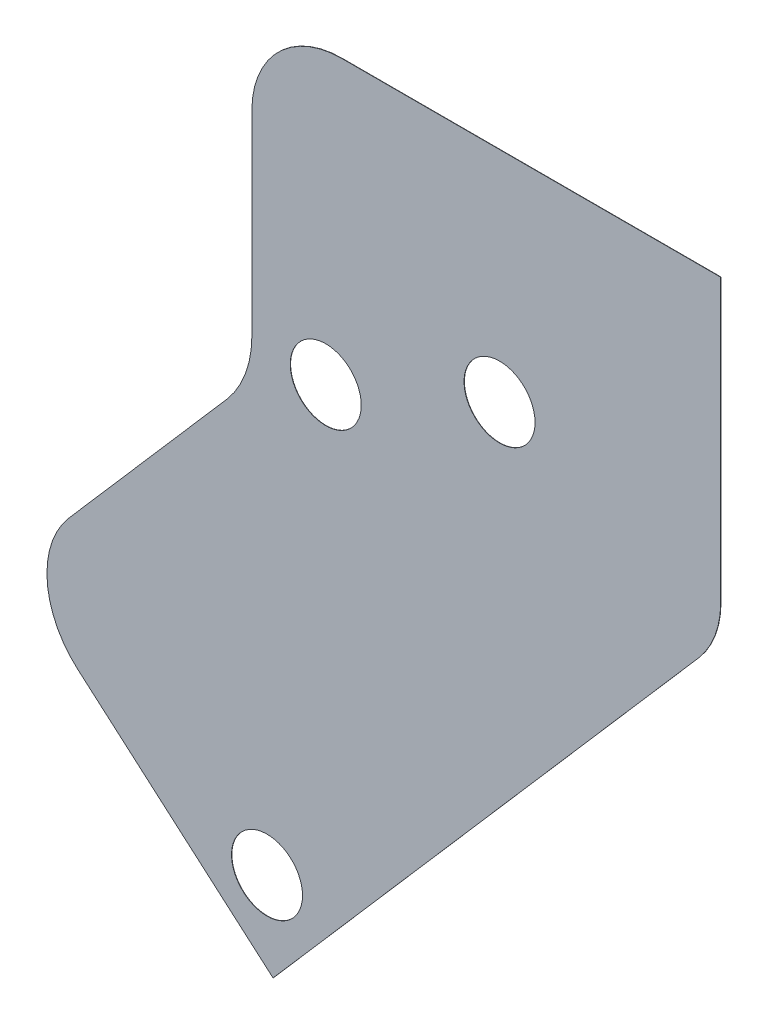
ISO-10303-21;
HEADER;
FILE_DESCRIPTION(('STEP AP214'),'2;1');
FILE_NAME('part.step','',(''),(''),'','','');
FILE_SCHEMA(('AUTOMOTIVE_DESIGN { 1 0 10303 214 1 1 1 1 }'));
ENDSEC;
DATA;
#1=APPLICATION_CONTEXT('core data for automotive mechanical design processes');
#2=APPLICATION_PROTOCOL_DEFINITION('international standard','automotive_design',2000,#1);
#3=PRODUCT_CONTEXT('',#1,'mechanical');
#4=PRODUCT('Part','Part','',(#3));
#5=PRODUCT_RELATED_PRODUCT_CATEGORY('part','',(#4));
#6=PRODUCT_DEFINITION_FORMATION('','',#4);
#7=PRODUCT_DEFINITION_CONTEXT('part definition',#1,'design');
#8=PRODUCT_DEFINITION('design','',#6,#7);
#9=PRODUCT_DEFINITION_SHAPE('','',#8);
#10=(LENGTH_UNIT() NAMED_UNIT(*) SI_UNIT(.MILLI.,.METRE.));
#11=(NAMED_UNIT(*) PLANE_ANGLE_UNIT() SI_UNIT($,.RADIAN.));
#12=(NAMED_UNIT(*) SI_UNIT($,.STERADIAN.) SOLID_ANGLE_UNIT());
#13=UNCERTAINTY_MEASURE_WITH_UNIT(LENGTH_MEASURE(1.E-05),#10,'distance_accuracy_value','');
#14=(GEOMETRIC_REPRESENTATION_CONTEXT(3) GLOBAL_UNCERTAINTY_ASSIGNED_CONTEXT((#13)) GLOBAL_UNIT_ASSIGNED_CONTEXT((#10,
#11,#12)) REPRESENTATION_CONTEXT('',''));
#15=CARTESIAN_POINT('',(0.,0.,0.));
#16=DIRECTION('',(0.,0.,1.));
#17=DIRECTION('',(1.,0.,0.));
#18=AXIS2_PLACEMENT_3D('',#15,#16,#17);
#19=CARTESIAN_POINT('',(-671.195,-35.989792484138,0.0254000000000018));
#20=DIRECTION('',(0.,0.,-1.));
#21=DIRECTION('',(-1.,0.,0.));
#22=AXIS2_PLACEMENT_3D('',#19,#20,#21);
#23=CYLINDRICAL_SURFACE('',#22,7.11199999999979);
#24=CARTESIAN_POINT('',(-671.195,-35.989792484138,0.));
#25=DIRECTION('',(0.,0.,1.));
#26=DIRECTION('',(1.,0.,0.));
#27=AXIS2_PLACEMENT_3D('',#24,#25,#26);
#28=CIRCLE('',#27,7.11199999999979);
#29=CARTESIAN_POINT('',(-665.825225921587,-40.6530606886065,0.));
#30=VERTEX_POINT('',#29);
#31=CARTESIAN_POINT('',(-664.083,-35.989792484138,0.));
#32=VERTEX_POINT('',#31);
#33=EDGE_CURVE('E159',#30,#32,#28,.T.);
#34=ORIENTED_EDGE('',*,*,#33,.T.);
#35=DIRECTION('',(0.,0.,-1.));
#36=VECTOR('',#35,1.);
#37=CARTESIAN_POINT('',(-664.083,-35.989792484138,0.0254000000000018));
#38=LINE('',#37,#36);
#39=CARTESIAN_POINT('',(-664.083,-35.989792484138,0.0254000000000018));
#40=VERTEX_POINT('',#39);
#41=EDGE_CURVE('E11',#40,#32,#38,.T.);
#42=ORIENTED_EDGE('',*,*,#41,.F.);
#43=CARTESIAN_POINT('',(-671.195,-35.989792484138,0.0254000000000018));
#44=DIRECTION('',(0.,0.,1.));
#45=DIRECTION('',(1.,0.,0.));
#46=AXIS2_PLACEMENT_3D('',#43,#44,#45);
#47=CIRCLE('',#46,7.11199999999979);
#48=CARTESIAN_POINT('',(-665.825225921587,-40.6530606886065,0.0254000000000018));
#49=VERTEX_POINT('',#48);
#50=EDGE_CURVE('E188',#49,#40,#47,.T.);
#51=ORIENTED_EDGE('',*,*,#50,.F.);
#52=DIRECTION('',(0.,0.,-1.));
#53=VECTOR('',#52,1.);
#54=CARTESIAN_POINT('',(-665.825225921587,-40.6530606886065,0.0254000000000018));
#55=LINE('',#54,#53);
#56=EDGE_CURVE('E155',#49,#30,#55,.T.);
#57=ORIENTED_EDGE('',*,*,#56,.T.);
#58=EDGE_LOOP('',(#34,#42,#51,#57));
#59=FACE_BOUND('',#58,.T.);
#60=ADVANCED_FACE('F45',(#59),#23,.T.);
#61=CARTESIAN_POINT('',(-664.083,-35.989792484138,0.0254000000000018));
#62=DIRECTION('',(-1.,0.,0.));
#63=DIRECTION('',(0.,0.,1.));
#64=AXIS2_PLACEMENT_3D('',#61,#62,#63);
#65=PLANE('',#64);
#66=DIRECTION('',(0.,1.,0.));
#67=VECTOR('',#66,1.);
#68=CARTESIAN_POINT('',(-664.083,-35.989792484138,0.));
#69=LINE('',#68,#67);
#70=CARTESIAN_POINT('',(-664.083,-13.7078728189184,0.));
#71=VERTEX_POINT('',#70);
#72=EDGE_CURVE('E163',#32,#71,#69,.T.);
#73=ORIENTED_EDGE('',*,*,#72,.T.);
#74=DIRECTION('',(0.,0.,-1.));
#75=VECTOR('',#74,1.);
#76=CARTESIAN_POINT('',(-664.083,-13.7078728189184,0.0254000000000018));
#77=LINE('',#76,#75);
#78=CARTESIAN_POINT('',(-664.083,-13.7078728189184,0.0254000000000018));
#79=VERTEX_POINT('',#78);
#80=EDGE_CURVE('E54',#79,#71,#77,.T.);
#81=ORIENTED_EDGE('',*,*,#80,.F.);
#82=DIRECTION('',(0.,1.,0.));
#83=VECTOR('',#82,1.);
#84=CARTESIAN_POINT('',(-664.083,-35.989792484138,0.0254000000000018));
#85=LINE('',#84,#83);
#86=EDGE_CURVE('E111',#40,#79,#85,.T.);
#87=ORIENTED_EDGE('',*,*,#86,.F.);
#88=ORIENTED_EDGE('',*,*,#41,.T.);
#89=EDGE_LOOP('',(#73,#81,#87,#88));
#90=FACE_BOUND('',#89,.T.);
#91=ADVANCED_FACE('F310',(#90),#65,.F.);
#92=CARTESIAN_POINT('',(-664.083,-13.7078728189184,0.0254000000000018));
#93=DIRECTION('',(0.,-1.,0.));
#94=DIRECTION('',(1.,0.,0.));
#95=AXIS2_PLACEMENT_3D('',#92,#93,#94);
#96=PLANE('',#95);
#97=DIRECTION('',(-1.,0.,0.));
#98=VECTOR('',#97,1.);
#99=CARTESIAN_POINT('',(-664.083,-13.7078728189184,0.));
#100=LINE('',#99,#98);
#101=CARTESIAN_POINT('',(-694.055,-13.7078728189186,0.));
#102=VERTEX_POINT('',#101);
#103=EDGE_CURVE('E167',#71,#102,#100,.T.);
#104=ORIENTED_EDGE('',*,*,#103,.T.);
#105=DIRECTION('',(0.,0.,-1.));
#106=VECTOR('',#105,1.);
#107=CARTESIAN_POINT('',(-694.055,-13.7078728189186,0.0254000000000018));
#108=LINE('',#107,#106);
#109=CARTESIAN_POINT('',(-694.055,-13.7078728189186,0.0254000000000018));
#110=VERTEX_POINT('',#109);
#111=EDGE_CURVE('E207',#110,#102,#108,.T.);
#112=ORIENTED_EDGE('',*,*,#111,.F.);
#113=DIRECTION('',(-1.,0.,0.));
#114=VECTOR('',#113,1.);
#115=CARTESIAN_POINT('',(-664.083,-13.7078728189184,0.0254000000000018));
#116=LINE('',#115,#114);
#117=EDGE_CURVE('E218',#79,#110,#116,.T.);
#118=ORIENTED_EDGE('',*,*,#117,.F.);
#119=ORIENTED_EDGE('',*,*,#80,.T.);
#120=EDGE_LOOP('',(#104,#112,#118,#119));
#121=FACE_BOUND('',#120,.T.);
#122=ADVANCED_FACE('F216',(#121),#96,.F.);
#123=CARTESIAN_POINT('',(-694.055,-20.8198728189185,0.0254000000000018));
#124=DIRECTION('',(0.,0.,-1.));
#125=DIRECTION('',(-1.,0.,0.));
#126=AXIS2_PLACEMENT_3D('',#123,#124,#125);
#127=CYLINDRICAL_SURFACE('',#126,7.11199999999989);
#128=CARTESIAN_POINT('',(-694.055,-20.8198728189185,0.));
#129=DIRECTION('',(0.,0.,1.));
#130=DIRECTION('',(1.,0.,0.));
#131=AXIS2_PLACEMENT_3D('',#128,#129,#130);
#132=CIRCLE('',#131,7.11199999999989);
#133=CARTESIAN_POINT('',(-701.167,-20.8198728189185,0.));
#134=VERTEX_POINT('',#133);
#135=EDGE_CURVE('E170',#102,#134,#132,.T.);
#136=ORIENTED_EDGE('',*,*,#135,.T.);
#137=DIRECTION('',(0.,0.,-1.));
#138=VECTOR('',#137,1.);
#139=CARTESIAN_POINT('',(-701.167,-20.8198728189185,0.0254000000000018));
#140=LINE('',#139,#138);
#141=CARTESIAN_POINT('',(-701.167,-20.8198728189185,0.0254000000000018));
#142=VERTEX_POINT('',#141);
#143=EDGE_CURVE('E203',#142,#134,#140,.T.);
#144=ORIENTED_EDGE('',*,*,#143,.F.);
#145=CARTESIAN_POINT('',(-694.055,-20.8198728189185,0.0254000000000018));
#146=DIRECTION('',(0.,0.,1.));
#147=DIRECTION('',(1.,0.,0.));
#148=AXIS2_PLACEMENT_3D('',#145,#146,#147);
#149=CIRCLE('',#148,7.11199999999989);
#150=EDGE_CURVE('E237',#110,#142,#149,.T.);
#151=ORIENTED_EDGE('',*,*,#150,.F.);
#152=ORIENTED_EDGE('',*,*,#111,.T.);
#153=EDGE_LOOP('',(#136,#144,#151,#152));
#154=FACE_BOUND('',#153,.T.);
#155=ADVANCED_FACE('F227',(#154),#127,.T.);
#156=CARTESIAN_POINT('',(-701.167,-20.8198728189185,0.0254000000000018));
#157=DIRECTION('',(1.,0.,0.));
#158=DIRECTION('',(0.,1.,0.));
#159=AXIS2_PLACEMENT_3D('',#156,#157,#158);
#160=PLANE('',#159);
#161=DIRECTION('',(0.,-1.,0.));
#162=VECTOR('',#161,1.);
#163=CARTESIAN_POINT('',(-701.167,-20.8198728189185,0.));
#164=LINE('',#163,#162);
#165=CARTESIAN_POINT('',(-701.167,-36.2820751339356,0.));
#166=VERTEX_POINT('',#165);
#167=EDGE_CURVE('E173',#134,#166,#164,.T.);
#168=ORIENTED_EDGE('',*,*,#167,.T.);
#169=DIRECTION('',(0.,0.,-1.));
#170=VECTOR('',#169,1.);
#171=CARTESIAN_POINT('',(-701.167,-36.2820751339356,0.0254000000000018));
#172=LINE('',#171,#170);
#173=CARTESIAN_POINT('',(-701.167,-36.2820751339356,0.0254000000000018));
#174=VERTEX_POINT('',#173);
#175=EDGE_CURVE('E199',#174,#166,#172,.T.);
#176=ORIENTED_EDGE('',*,*,#175,.F.);
#177=DIRECTION('',(0.,-1.,0.));
#178=VECTOR('',#177,1.);
#179=CARTESIAN_POINT('',(-701.167,-20.8198728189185,0.0254000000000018));
#180=LINE('',#179,#178);
#181=EDGE_CURVE('E233',#142,#174,#180,.T.);
#182=ORIENTED_EDGE('',*,*,#181,.F.);
#183=ORIENTED_EDGE('',*,*,#143,.T.);
#184=EDGE_LOOP('',(#168,#176,#182,#183));
#185=FACE_BOUND('',#184,.T.);
#186=ADVANCED_FACE('F231',(#185),#160,.F.);
#187=CARTESIAN_POINT('',(-709.295,-36.2820751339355,0.0254000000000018));
#188=DIRECTION('',(0.,0.,-1.));
#189=DIRECTION('',(-1.,0.,0.));
#190=AXIS2_PLACEMENT_3D('',#187,#188,#189);
#191=CYLINDRICAL_SURFACE('',#190,8.12799999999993);
#192=CARTESIAN_POINT('',(-709.295,-36.2820751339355,0.));
#193=DIRECTION('',(0.,0.,-1.));
#194=DIRECTION('',(1.,0.,0.));
#195=AXIS2_PLACEMENT_3D('',#192,#193,#194);
#196=CIRCLE('',#195,8.12799999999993);
#197=CARTESIAN_POINT('',(-703.158115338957,-41.6115245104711,0.));
#198=VERTEX_POINT('',#197);
#199=EDGE_CURVE('E176',#166,#198,#196,.T.);
#200=ORIENTED_EDGE('',*,*,#199,.T.);
#201=DIRECTION('',(0.,0.,-1.));
#202=VECTOR('',#201,1.);
#203=CARTESIAN_POINT('',(-703.158115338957,-41.6115245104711,0.0254000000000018));
#204=LINE('',#203,#202);
#205=CARTESIAN_POINT('',(-703.158115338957,-41.6115245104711,0.0254000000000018));
#206=VERTEX_POINT('',#205);
#207=EDGE_CURVE('E195',#206,#198,#204,.T.);
#208=ORIENTED_EDGE('',*,*,#207,.F.);
#209=CARTESIAN_POINT('',(-709.295,-36.2820751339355,0.0254000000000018));
#210=DIRECTION('',(0.,0.,-1.));
#211=DIRECTION('',(1.,0.,0.));
#212=AXIS2_PLACEMENT_3D('',#209,#210,#211);
#213=CIRCLE('',#212,8.12799999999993);
#214=EDGE_CURVE('E236',#174,#206,#213,.T.);
#215=ORIENTED_EDGE('',*,*,#214,.F.);
#216=ORIENTED_EDGE('',*,*,#175,.T.);
#217=EDGE_LOOP('',(#200,#208,#215,#216));
#218=FACE_BOUND('',#217,.T.);
#219=ADVANCED_FACE('F322',(#218),#191,.F.);
#220=CARTESIAN_POINT('',(-703.158115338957,-41.6115245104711,0.0254000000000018));
#221=DIRECTION('',(0.75503010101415,-0.655690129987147,0.));
#222=DIRECTION('',(0.655690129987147,0.75503010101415,0.));
#223=AXIS2_PLACEMENT_3D('',#220,#221,#222);
#224=PLANE('',#223);
#225=DIRECTION('',(-0.655690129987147,-0.75503010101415,0.));
#226=VECTOR('',#225,1.);
#227=CARTESIAN_POINT('',(-703.158115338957,-41.6115245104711,0.));
#228=LINE('',#227,#226);
#229=CARTESIAN_POINT('',(-715.634869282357,-55.9785621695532,0.));
#230=VERTEX_POINT('',#229);
#231=EDGE_CURVE('E179',#198,#230,#228,.T.);
#232=ORIENTED_EDGE('',*,*,#231,.T.);
#233=DIRECTION('',(0.,0.,-1.));
#234=VECTOR('',#233,1.);
#235=CARTESIAN_POINT('',(-715.634869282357,-55.9785621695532,0.0254000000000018));
#236=LINE('',#235,#234);
#237=CARTESIAN_POINT('',(-715.634869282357,-55.9785621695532,0.0254000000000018));
#238=VERTEX_POINT('',#237);
#239=EDGE_CURVE('E147',#238,#230,#236,.T.);
#240=ORIENTED_EDGE('',*,*,#239,.F.);
#241=DIRECTION('',(-0.655690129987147,-0.75503010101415,0.));
#242=VECTOR('',#241,1.);
#243=CARTESIAN_POINT('',(-703.158115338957,-41.6115245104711,0.0254000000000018));
#244=LINE('',#243,#242);
#245=EDGE_CURVE('E136',#206,#238,#244,.T.);
#246=ORIENTED_EDGE('',*,*,#245,.F.);
#247=ORIENTED_EDGE('',*,*,#207,.T.);
#248=EDGE_LOOP('',(#232,#240,#246,#247));
#249=FACE_BOUND('',#248,.T.);
#250=ADVANCED_FACE('F319',(#249),#224,.F.);
#251=CARTESIAN_POINT('',(-710.265095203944,-60.6418303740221,0.0254000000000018));
#252=DIRECTION('',(0.,0.,-1.));
#253=DIRECTION('',(-1.,0.,0.));
#254=AXIS2_PLACEMENT_3D('',#251,#252,#253);
#255=CYLINDRICAL_SURFACE('',#254,7.11200000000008);
#256=CARTESIAN_POINT('',(-710.265095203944,-60.6418303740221,0.));
#257=DIRECTION('',(0.,0.,1.));
#258=DIRECTION('',(1.,0.,0.));
#259=AXIS2_PLACEMENT_3D('',#256,#257,#258);
#260=CIRCLE('',#259,7.11200000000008);
#261=CARTESIAN_POINT('',(-714.928363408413,-66.0116044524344,0.));
#262=VERTEX_POINT('',#261);
#263=EDGE_CURVE('E145',#230,#262,#260,.T.);
#264=ORIENTED_EDGE('',*,*,#263,.T.);
#265=DIRECTION('',(0.,0.,-1.));
#266=VECTOR('',#265,1.);
#267=CARTESIAN_POINT('',(-714.928363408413,-66.0116044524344,0.0254000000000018));
#268=LINE('',#267,#266);
#269=CARTESIAN_POINT('',(-714.928363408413,-66.0116044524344,0.0254000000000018));
#270=VERTEX_POINT('',#269);
#271=EDGE_CURVE('E142',#270,#262,#268,.T.);
#272=ORIENTED_EDGE('',*,*,#271,.F.);
#273=CARTESIAN_POINT('',(-710.265095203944,-60.6418303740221,0.0254000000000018));
#274=DIRECTION('',(0.,0.,1.));
#275=DIRECTION('',(1.,0.,0.));
#276=AXIS2_PLACEMENT_3D('',#273,#274,#275);
#277=CIRCLE('',#276,7.11200000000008);
#278=EDGE_CURVE('E130',#238,#270,#277,.T.);
#279=ORIENTED_EDGE('',*,*,#278,.F.);
#280=ORIENTED_EDGE('',*,*,#239,.T.);
#281=EDGE_LOOP('',(#264,#272,#279,#280));
#282=FACE_BOUND('',#281,.T.);
#283=ADVANCED_FACE('F143',(#282),#255,.T.);
#284=CARTESIAN_POINT('',(-714.928363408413,-66.0116044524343,0.0254000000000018));
#285=DIRECTION('',(0.655690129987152,0.755030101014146,0.));
#286=DIRECTION('',(-0.755030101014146,0.655690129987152,0.));
#287=AXIS2_PLACEMENT_3D('',#284,#285,#286);
#288=PLANE('',#287);
#289=DIRECTION('',(0.755030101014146,-0.655690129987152,0.));
#290=VECTOR('',#289,1.);
#291=CARTESIAN_POINT('',(-714.928363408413,-66.0116044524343,0.));
#292=LINE('',#291,#290);
#293=CARTESIAN_POINT('',(-699.490262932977,-79.4185005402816,0.));
#294=VERTEX_POINT('',#293);
#295=EDGE_CURVE('E97',#262,#294,#292,.T.);
#296=ORIENTED_EDGE('',*,*,#295,.T.);
#297=DIRECTION('',(0.,0.,-1.));
#298=VECTOR('',#297,1.);
#299=CARTESIAN_POINT('',(-699.490262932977,-79.4185005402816,0.0254000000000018));
#300=LINE('',#299,#298);
#301=CARTESIAN_POINT('',(-699.490262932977,-79.4185005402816,0.0254000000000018));
#302=VERTEX_POINT('',#301);
#303=EDGE_CURVE('E148',#302,#294,#300,.T.);
#304=ORIENTED_EDGE('',*,*,#303,.F.);
#305=DIRECTION('',(0.755030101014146,-0.655690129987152,0.));
#306=VECTOR('',#305,1.);
#307=CARTESIAN_POINT('',(-714.928363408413,-66.0116044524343,0.0254000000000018));
#308=LINE('',#307,#306);
#309=EDGE_CURVE('E134',#270,#302,#308,.T.);
#310=ORIENTED_EDGE('',*,*,#309,.F.);
#311=ORIENTED_EDGE('',*,*,#271,.T.);
#312=EDGE_LOOP('',(#296,#304,#310,#311));
#313=FACE_BOUND('',#312,.T.);
#314=ADVANCED_FACE('F150',(#313),#288,.F.);
#315=CARTESIAN_POINT('',(-699.490262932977,-79.4185005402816,0.0254000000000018));
#316=DIRECTION('',(-0.75503010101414,0.655690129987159,0.));
#317=DIRECTION('',(-0.655690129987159,-0.75503010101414,0.));
#318=AXIS2_PLACEMENT_3D('',#315,#316,#317);
#319=PLANE('',#318);
#320=DIRECTION('',(0.655690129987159,0.75503010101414,0.));
#321=VECTOR('',#320,1.);
#322=CARTESIAN_POINT('',(-699.490262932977,-79.4185005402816,0.));
#323=LINE('',#322,#321);
#324=EDGE_CURVE('E103',#294,#30,#323,.T.);
#325=ORIENTED_EDGE('',*,*,#324,.T.);
#326=ORIENTED_EDGE('',*,*,#56,.F.);
#327=DIRECTION('',(0.655690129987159,0.75503010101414,0.));
#328=VECTOR('',#327,1.);
#329=CARTESIAN_POINT('',(-699.490262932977,-79.4185005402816,0.0254000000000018));
#330=LINE('',#329,#328);
#331=EDGE_CURVE('E62',#302,#49,#330,.T.);
#332=ORIENTED_EDGE('',*,*,#331,.F.);
#333=ORIENTED_EDGE('',*,*,#303,.T.);
#334=EDGE_LOOP('',(#325,#326,#332,#333));
#335=FACE_BOUND('',#334,.T.);
#336=ADVANCED_FACE('F291',(#335),#319,.F.);
#337=CARTESIAN_POINT('',(-671.195,-35.989792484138,0.0254000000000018));
#338=DIRECTION('',(0.,0.,1.));
#339=DIRECTION('',(1.,0.,0.));
#340=AXIS2_PLACEMENT_3D('',#337,#338,#339);
#341=PLANE('',#340);
#342=CARTESIAN_POINT('',(-695.325000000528,-36.6948728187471,0.0254000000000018));
#343=DIRECTION('',(0.,0.,1.));
#344=DIRECTION('',(1.,0.,0.));
#345=AXIS2_PLACEMENT_3D('',#342,#343,#344);
#346=CIRCLE('',#345,2.80670000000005);
#347=CARTESIAN_POINT('',(-692.518300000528,-36.6948728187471,0.0254000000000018));
#348=VERTEX_POINT('',#347);
#349=EDGE_CURVE('E270',#348,#348,#346,.T.);
#350=ORIENTED_EDGE('',*,*,#349,.F.);
#351=EDGE_LOOP('',(#350));
#352=FACE_BOUND('',#351,.T.);
#353=CARTESIAN_POINT('',(-681.576795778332,-31.0085922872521,0.0254000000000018));
#354=DIRECTION('',(0.,0.,1.));
#355=DIRECTION('',(1.,0.,0.));
#356=AXIS2_PLACEMENT_3D('',#353,#354,#355);
#357=CIRCLE('',#356,2.80670000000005);
#358=CARTESIAN_POINT('',(-678.770095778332,-31.0085922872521,0.0254000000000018));
#359=VERTEX_POINT('',#358);
#360=EDGE_CURVE('E262',#359,#359,#357,.T.);
#361=ORIENTED_EDGE('',*,*,#360,.F.);
#362=EDGE_LOOP('',(#361));
#363=FACE_BOUND('',#362,.T.);
#364=CARTESIAN_POINT('',(-699.969677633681,-72.610364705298,0.0254000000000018));
#365=DIRECTION('',(0.,0.,1.));
#366=DIRECTION('',(1.,0.,0.));
#367=AXIS2_PLACEMENT_3D('',#364,#365,#366);
#368=CIRCLE('',#367,2.80670000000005);
#369=CARTESIAN_POINT('',(-697.162977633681,-72.610364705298,0.0254000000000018));
#370=VERTEX_POINT('',#369);
#371=EDGE_CURVE('E164',#370,#370,#368,.T.);
#372=ORIENTED_EDGE('',*,*,#371,.F.);
#373=EDGE_LOOP('',(#372));
#374=FACE_BOUND('',#373,.T.);
#375=ORIENTED_EDGE('',*,*,#50,.T.);
#376=ORIENTED_EDGE('',*,*,#86,.T.);
#377=ORIENTED_EDGE('',*,*,#117,.T.);
#378=ORIENTED_EDGE('',*,*,#150,.T.);
#379=ORIENTED_EDGE('',*,*,#181,.T.);
#380=ORIENTED_EDGE('',*,*,#214,.T.);
#381=ORIENTED_EDGE('',*,*,#245,.T.);
#382=ORIENTED_EDGE('',*,*,#278,.T.);
#383=ORIENTED_EDGE('',*,*,#309,.T.);
#384=ORIENTED_EDGE('',*,*,#331,.T.);
#385=EDGE_LOOP('',(#375,#376,#377,#378,#379,#380,#381,#382,#383,#384));
#386=FACE_BOUND('',#385,.T.);
#387=ADVANCED_FACE('F132',(#352,#363,#374,#386),#341,.T.);
#388=CARTESIAN_POINT('',(-671.195,-35.989792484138,0.));
#389=DIRECTION('',(0.,0.,1.));
#390=DIRECTION('',(1.,0.,0.));
#391=AXIS2_PLACEMENT_3D('',#388,#389,#390);
#392=PLANE('',#391);
#393=CARTESIAN_POINT('',(-695.325000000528,-36.6948728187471,0.));
#394=DIRECTION('',(0.,0.,1.));
#395=DIRECTION('',(1.,0.,0.));
#396=AXIS2_PLACEMENT_3D('',#393,#394,#395);
#397=CIRCLE('',#396,2.80670000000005);
#398=CARTESIAN_POINT('',(-692.518300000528,-36.6948728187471,0.));
#399=VERTEX_POINT('',#398);
#400=EDGE_CURVE('E274',#399,#399,#397,.T.);
#401=ORIENTED_EDGE('',*,*,#400,.T.);
#402=EDGE_LOOP('',(#401));
#403=FACE_BOUND('',#402,.T.);
#404=CARTESIAN_POINT('',(-681.576795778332,-31.0085922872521,0.));
#405=DIRECTION('',(0.,0.,1.));
#406=DIRECTION('',(1.,0.,0.));
#407=AXIS2_PLACEMENT_3D('',#404,#405,#406);
#408=CIRCLE('',#407,2.80670000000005);
#409=CARTESIAN_POINT('',(-678.770095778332,-31.0085922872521,0.));
#410=VERTEX_POINT('',#409);
#411=EDGE_CURVE('E266',#410,#410,#408,.T.);
#412=ORIENTED_EDGE('',*,*,#411,.T.);
#413=EDGE_LOOP('',(#412));
#414=FACE_BOUND('',#413,.T.);
#415=CARTESIAN_POINT('',(-699.969677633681,-72.610364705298,0.));
#416=DIRECTION('',(0.,0.,1.));
#417=DIRECTION('',(1.,0.,0.));
#418=AXIS2_PLACEMENT_3D('',#415,#416,#417);
#419=CIRCLE('',#418,2.80670000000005);
#420=CARTESIAN_POINT('',(-697.162977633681,-72.610364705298,0.));
#421=VERTEX_POINT('',#420);
#422=EDGE_CURVE('E258',#421,#421,#419,.T.);
#423=ORIENTED_EDGE('',*,*,#422,.T.);
#424=EDGE_LOOP('',(#423));
#425=FACE_BOUND('',#424,.T.);
#426=ORIENTED_EDGE('',*,*,#33,.F.);
#427=ORIENTED_EDGE('',*,*,#324,.F.);
#428=ORIENTED_EDGE('',*,*,#295,.F.);
#429=ORIENTED_EDGE('',*,*,#263,.F.);
#430=ORIENTED_EDGE('',*,*,#231,.F.);
#431=ORIENTED_EDGE('',*,*,#199,.F.);
#432=ORIENTED_EDGE('',*,*,#167,.F.);
#433=ORIENTED_EDGE('',*,*,#135,.F.);
#434=ORIENTED_EDGE('',*,*,#103,.F.);
#435=ORIENTED_EDGE('',*,*,#72,.F.);
#436=EDGE_LOOP('',(#426,#427,#428,#429,#430,#431,#432,#433,#434,#435));
#437=FACE_BOUND('',#436,.T.);
#438=ADVANCED_FACE('F222',(#403,#414,#425,#437),#392,.F.);
#439=CARTESIAN_POINT('',(-699.969677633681,-72.610364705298,0.0254000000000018));
#440=DIRECTION('',(0.,0.,1.));
#441=DIRECTION('',(1.,0.,0.));
#442=AXIS2_PLACEMENT_3D('',#439,#440,#441);
#443=CYLINDRICAL_SURFACE('',#442,2.80670000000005);
#444=ORIENTED_EDGE('',*,*,#422,.F.);
#445=EDGE_LOOP('',(#444));
#446=FACE_BOUND('',#445,.T.);
#447=ORIENTED_EDGE('',*,*,#371,.T.);
#448=EDGE_LOOP('',(#447));
#449=FACE_BOUND('',#448,.T.);
#450=ADVANCED_FACE('F297',(#446,#449),#443,.F.);
#451=CARTESIAN_POINT('',(-681.576795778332,-31.0085922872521,0.0254000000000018));
#452=DIRECTION('',(0.,0.,1.));
#453=DIRECTION('',(1.,0.,0.));
#454=AXIS2_PLACEMENT_3D('',#451,#452,#453);
#455=CYLINDRICAL_SURFACE('',#454,2.80670000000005);
#456=ORIENTED_EDGE('',*,*,#411,.F.);
#457=EDGE_LOOP('',(#456));
#458=FACE_BOUND('',#457,.T.);
#459=ORIENTED_EDGE('',*,*,#360,.T.);
#460=EDGE_LOOP('',(#459));
#461=FACE_BOUND('',#460,.T.);
#462=ADVANCED_FACE('F285',(#458,#461),#455,.F.);
#463=CARTESIAN_POINT('',(-695.325000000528,-36.6948728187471,0.0254000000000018));
#464=DIRECTION('',(0.,0.,1.));
#465=DIRECTION('',(1.,0.,0.));
#466=AXIS2_PLACEMENT_3D('',#463,#464,#465);
#467=CYLINDRICAL_SURFACE('',#466,2.80670000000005);
#468=ORIENTED_EDGE('',*,*,#400,.F.);
#469=EDGE_LOOP('',(#468));
#470=FACE_BOUND('',#469,.T.);
#471=ORIENTED_EDGE('',*,*,#349,.T.);
#472=EDGE_LOOP('',(#471));
#473=FACE_BOUND('',#472,.T.);
#474=ADVANCED_FACE('F282',(#470,#473),#467,.F.);
#475=CLOSED_SHELL('',(#60,#91,#122,#155,#186,#219,#250,#283,#314,#336,#387,#438,#450,#462,#474));
#476=MANIFOLD_SOLID_BREP('B2',#475);
#477=ADVANCED_BREP_SHAPE_REPRESENTATION('',(#18,#476),#14);
#478=SHAPE_DEFINITION_REPRESENTATION(#9,#477);
ENDSEC;
END-ISO-10303-21;
